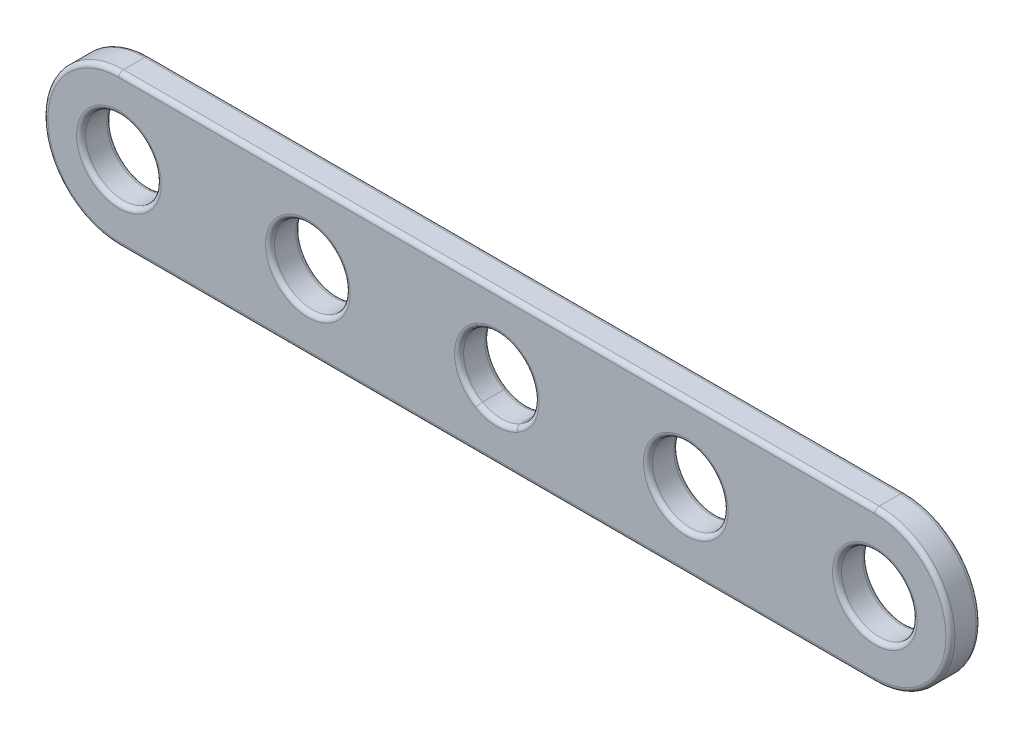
ISO-10303-21;
HEADER;
FILE_DESCRIPTION(('STEP AP214'),'2;1');
FILE_NAME('part.step','',(''),(''),'','','');
FILE_SCHEMA(('AUTOMOTIVE_DESIGN { 1 0 10303 214 1 1 1 1 }'));
ENDSEC;
DATA;
#1=APPLICATION_CONTEXT('core data for automotive mechanical design processes');
#2=APPLICATION_PROTOCOL_DEFINITION('international standard','automotive_design',2000,#1);
#3=PRODUCT_CONTEXT('',#1,'mechanical');
#4=PRODUCT('Part','Part','',(#3));
#5=PRODUCT_RELATED_PRODUCT_CATEGORY('part','',(#4));
#6=PRODUCT_DEFINITION_FORMATION('','',#4);
#7=PRODUCT_DEFINITION_CONTEXT('part definition',#1,'design');
#8=PRODUCT_DEFINITION('design','',#6,#7);
#9=PRODUCT_DEFINITION_SHAPE('','',#8);
#10=(LENGTH_UNIT() NAMED_UNIT(*) SI_UNIT(.MILLI.,.METRE.));
#11=(NAMED_UNIT(*) PLANE_ANGLE_UNIT() SI_UNIT($,.RADIAN.));
#12=(NAMED_UNIT(*) SI_UNIT($,.STERADIAN.) SOLID_ANGLE_UNIT());
#13=UNCERTAINTY_MEASURE_WITH_UNIT(LENGTH_MEASURE(1.E-05),#10,'distance_accuracy_value','');
#14=(GEOMETRIC_REPRESENTATION_CONTEXT(3) GLOBAL_UNCERTAINTY_ASSIGNED_CONTEXT((#13)) GLOBAL_UNIT_ASSIGNED_CONTEXT((#10,
#11,#12)) REPRESENTATION_CONTEXT('',''));
#15=CARTESIAN_POINT('',(0.,0.,0.));
#16=DIRECTION('',(0.,0.,1.));
#17=DIRECTION('',(1.,0.,0.));
#18=AXIS2_PLACEMENT_3D('',#15,#16,#17);
#19=CARTESIAN_POINT('',(250.,50.,0.));
#20=DIRECTION('',(0.,0.,1.));
#21=DIRECTION('',(1.,0.,0.));
#22=AXIS2_PLACEMENT_3D('',#19,#20,#21);
#23=CYLINDRICAL_SURFACE('',#22,25.);
#24=DIRECTION('',(0.,0.,1.));
#25=VECTOR('',#24,1.);
#26=CARTESIAN_POINT('',(262.5,28.349364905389,0.));
#27=LINE('',#26,#25);
#28=CARTESIAN_POINT('',(262.5,28.349364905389,17.));
#29=VERTEX_POINT('',#28);
#30=CARTESIAN_POINT('',(262.5,28.349364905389,3.));
#31=VERTEX_POINT('',#30);
#32=EDGE_CURVE('E328',#29,#31,#27,.F.);
#33=ORIENTED_EDGE('',*,*,#32,.F.);
#34=CARTESIAN_POINT('',(250.,50.,17.));
#35=DIRECTION('',(0.,0.,1.));
#36=DIRECTION('',(1.,0.,0.));
#37=AXIS2_PLACEMENT_3D('',#34,#35,#36);
#38=CIRCLE('',#37,25.);
#39=CARTESIAN_POINT('',(262.5,71.650635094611,17.));
#40=VERTEX_POINT('',#39);
#41=EDGE_CURVE('E229',#29,#40,#38,.T.);
#42=ORIENTED_EDGE('',*,*,#41,.T.);
#43=DIRECTION('',(0.,0.,1.));
#44=VECTOR('',#43,1.);
#45=CARTESIAN_POINT('',(262.5,71.650635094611,0.));
#46=LINE('',#45,#44);
#47=CARTESIAN_POINT('',(262.5,71.650635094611,3.));
#48=VERTEX_POINT('',#47);
#49=EDGE_CURVE('E324',#48,#40,#46,.T.);
#50=ORIENTED_EDGE('',*,*,#49,.F.);
#51=CARTESIAN_POINT('',(250.,50.,3.));
#52=DIRECTION('',(0.,0.,1.));
#53=DIRECTION('',(1.,0.,0.));
#54=AXIS2_PLACEMENT_3D('',#51,#52,#53);
#55=CIRCLE('',#54,25.);
#56=EDGE_CURVE('E226',#48,#31,#55,.F.);
#57=ORIENTED_EDGE('',*,*,#56,.T.);
#58=EDGE_LOOP('',(#33,#42,#50,#57));
#59=FACE_BOUND('',#58,.T.);
#60=ADVANCED_FACE('F31',(#59),#23,.F.);
#61=DIRECTION('',(0.,0.,1.));
#62=VECTOR('',#61,1.);
#63=CARTESIAN_POINT('',(237.5,28.349364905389,0.));
#64=LINE('',#63,#62);
#65=CARTESIAN_POINT('',(237.5,28.349364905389,3.));
#66=VERTEX_POINT('',#65);
#67=CARTESIAN_POINT('',(237.5,28.349364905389,17.));
#68=VERTEX_POINT('',#67);
#69=EDGE_CURVE('E316',#66,#68,#64,.T.);
#70=ORIENTED_EDGE('',*,*,#69,.T.);
#71=CARTESIAN_POINT('',(250.,50.,17.));
#72=DIRECTION('',(0.,0.,1.));
#73=DIRECTION('',(1.,0.,0.));
#74=AXIS2_PLACEMENT_3D('',#71,#72,#73);
#75=CIRCLE('',#74,25.);
#76=EDGE_CURVE('E224',#68,#29,#75,.T.);
#77=ORIENTED_EDGE('',*,*,#76,.T.);
#78=ORIENTED_EDGE('',*,*,#32,.T.);
#79=CARTESIAN_POINT('',(250.,50.,3.));
#80=DIRECTION('',(0.,0.,1.));
#81=DIRECTION('',(1.,0.,0.));
#82=AXIS2_PLACEMENT_3D('',#79,#80,#81);
#83=CIRCLE('',#82,25.);
#84=EDGE_CURVE('E222',#31,#66,#83,.F.);
#85=ORIENTED_EDGE('',*,*,#84,.T.);
#86=EDGE_LOOP('',(#70,#77,#78,#85));
#87=FACE_BOUND('',#86,.T.);
#88=ADVANCED_FACE('F350',(#87),#23,.F.);
#89=DIRECTION('',(0.,0.,1.));
#90=VECTOR('',#89,1.);
#91=CARTESIAN_POINT('',(237.5,71.650635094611,0.));
#92=LINE('',#91,#90);
#93=CARTESIAN_POINT('',(237.5,71.650635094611,17.));
#94=VERTEX_POINT('',#93);
#95=CARTESIAN_POINT('',(237.5,71.650635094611,3.));
#96=VERTEX_POINT('',#95);
#97=EDGE_CURVE('E320',#94,#96,#92,.F.);
#98=ORIENTED_EDGE('',*,*,#97,.F.);
#99=CARTESIAN_POINT('',(250.,50.,17.));
#100=DIRECTION('',(0.,0.,1.));
#101=DIRECTION('',(1.,0.,0.));
#102=AXIS2_PLACEMENT_3D('',#99,#100,#101);
#103=CIRCLE('',#102,25.);
#104=EDGE_CURVE('E150',#94,#68,#103,.T.);
#105=ORIENTED_EDGE('',*,*,#104,.T.);
#106=ORIENTED_EDGE('',*,*,#69,.F.);
#107=CARTESIAN_POINT('',(250.,50.,3.));
#108=DIRECTION('',(0.,0.,1.));
#109=DIRECTION('',(1.,0.,0.));
#110=AXIS2_PLACEMENT_3D('',#107,#108,#109);
#111=CIRCLE('',#110,25.);
#112=EDGE_CURVE('E219',#66,#96,#111,.F.);
#113=ORIENTED_EDGE('',*,*,#112,.T.);
#114=EDGE_LOOP('',(#98,#105,#106,#113));
#115=FACE_BOUND('',#114,.T.);
#116=ADVANCED_FACE('F348',(#115),#23,.F.);
#117=CARTESIAN_POINT('',(0.,50.,20.));
#118=DIRECTION('',(0.,0.,-1.));
#119=DIRECTION('',(-1.,0.,0.));
#120=AXIS2_PLACEMENT_3D('',#117,#118,#119);
#121=CYLINDRICAL_SURFACE('',#120,50.);
#122=DIRECTION('',(0.,0.,-1.));
#123=VECTOR('',#122,1.);
#124=CARTESIAN_POINT('',(0.,0.,20.));
#125=LINE('',#124,#123);
#126=CARTESIAN_POINT('',(0.,0.,17.));
#127=VERTEX_POINT('',#126);
#128=CARTESIAN_POINT('',(0.,0.,3.));
#129=VERTEX_POINT('',#128);
#130=EDGE_CURVE('E313',#127,#129,#125,.T.);
#131=ORIENTED_EDGE('',*,*,#130,.F.);
#132=CARTESIAN_POINT('',(0.,50.,17.));
#133=DIRECTION('',(0.,0.,1.));
#134=DIRECTION('',(1.,0.,0.));
#135=AXIS2_PLACEMENT_3D('',#132,#133,#134);
#136=CIRCLE('',#135,50.);
#137=CARTESIAN_POINT('',(0.,100.,17.));
#138=VERTEX_POINT('',#137);
#139=EDGE_CURVE('E205',#127,#138,#136,.F.);
#140=ORIENTED_EDGE('',*,*,#139,.T.);
#141=DIRECTION('',(0.,0.,-1.));
#142=VECTOR('',#141,1.);
#143=CARTESIAN_POINT('',(0.,100.,20.));
#144=LINE('',#143,#142);
#145=CARTESIAN_POINT('',(0.,100.,3.));
#146=VERTEX_POINT('',#145);
#147=EDGE_CURVE('E304',#138,#146,#144,.T.);
#148=ORIENTED_EDGE('',*,*,#147,.T.);
#149=CARTESIAN_POINT('',(0.,50.,3.));
#150=DIRECTION('',(0.,0.,1.));
#151=DIRECTION('',(1.,0.,0.));
#152=AXIS2_PLACEMENT_3D('',#149,#150,#151);
#153=CIRCLE('',#152,50.);
#154=EDGE_CURVE('E203',#146,#129,#153,.T.);
#155=ORIENTED_EDGE('',*,*,#154,.T.);
#156=EDGE_LOOP('',(#131,#140,#148,#155));
#157=FACE_BOUND('',#156,.T.);
#158=ADVANCED_FACE('F33',(#157),#121,.T.);
#159=CARTESIAN_POINT('',(0.,0.,20.));
#160=DIRECTION('',(0.,1.,0.));
#161=DIRECTION('',(0.,0.,1.));
#162=AXIS2_PLACEMENT_3D('',#159,#160,#161);
#163=PLANE('',#162);
#164=DIRECTION('',(0.,0.,-1.));
#165=VECTOR('',#164,1.);
#166=CARTESIAN_POINT('',(500.,0.,20.));
#167=LINE('',#166,#165);
#168=CARTESIAN_POINT('',(500.,0.,17.));
#169=VERTEX_POINT('',#168);
#170=CARTESIAN_POINT('',(500.,0.,3.));
#171=VERTEX_POINT('',#170);
#172=EDGE_CURVE('E310',#169,#171,#167,.T.);
#173=ORIENTED_EDGE('',*,*,#172,.F.);
#174=DIRECTION('',(1.,0.,0.));
#175=VECTOR('',#174,1.);
#176=CARTESIAN_POINT('',(0.,0.,17.));
#177=LINE('',#176,#175);
#178=EDGE_CURVE('E201',#169,#127,#177,.F.);
#179=ORIENTED_EDGE('',*,*,#178,.T.);
#180=ORIENTED_EDGE('',*,*,#130,.T.);
#181=DIRECTION('',(1.,0.,0.));
#182=VECTOR('',#181,1.);
#183=CARTESIAN_POINT('',(0.,0.,3.));
#184=LINE('',#183,#182);
#185=EDGE_CURVE('E198',#129,#171,#184,.T.);
#186=ORIENTED_EDGE('',*,*,#185,.T.);
#187=EDGE_LOOP('',(#173,#179,#180,#186));
#188=FACE_BOUND('',#187,.T.);
#189=ADVANCED_FACE('F387',(#188),#163,.F.);
#190=CARTESIAN_POINT('',(500.,50.,20.));
#191=DIRECTION('',(0.,0.,-1.));
#192=DIRECTION('',(-1.,0.,0.));
#193=AXIS2_PLACEMENT_3D('',#190,#191,#192);
#194=CYLINDRICAL_SURFACE('',#193,50.);
#195=DIRECTION('',(0.,0.,-1.));
#196=VECTOR('',#195,1.);
#197=CARTESIAN_POINT('',(500.,100.,20.));
#198=LINE('',#197,#196);
#199=CARTESIAN_POINT('',(500.,100.,17.));
#200=VERTEX_POINT('',#199);
#201=CARTESIAN_POINT('',(500.,100.,3.));
#202=VERTEX_POINT('',#201);
#203=EDGE_CURVE('E307',#200,#202,#198,.T.);
#204=ORIENTED_EDGE('',*,*,#203,.F.);
#205=CARTESIAN_POINT('',(500.,50.,17.));
#206=DIRECTION('',(0.,0.,1.));
#207=DIRECTION('',(1.,0.,0.));
#208=AXIS2_PLACEMENT_3D('',#205,#206,#207);
#209=CIRCLE('',#208,50.);
#210=EDGE_CURVE('E196',#200,#169,#209,.F.);
#211=ORIENTED_EDGE('',*,*,#210,.T.);
#212=ORIENTED_EDGE('',*,*,#172,.T.);
#213=CARTESIAN_POINT('',(500.,50.,3.));
#214=DIRECTION('',(0.,0.,1.));
#215=DIRECTION('',(1.,0.,0.));
#216=AXIS2_PLACEMENT_3D('',#213,#214,#215);
#217=CIRCLE('',#216,50.);
#218=EDGE_CURVE('E194',#171,#202,#217,.T.);
#219=ORIENTED_EDGE('',*,*,#218,.T.);
#220=EDGE_LOOP('',(#204,#211,#212,#219));
#221=FACE_BOUND('',#220,.T.);
#222=ADVANCED_FACE('F392',(#221),#194,.T.);
#223=CARTESIAN_POINT('',(0.,100.,20.));
#224=DIRECTION('',(0.,-1.,0.));
#225=DIRECTION('',(0.,0.,-1.));
#226=AXIS2_PLACEMENT_3D('',#223,#224,#225);
#227=PLANE('',#226);
#228=ORIENTED_EDGE('',*,*,#147,.F.);
#229=DIRECTION('',(-1.,0.,0.));
#230=VECTOR('',#229,1.);
#231=CARTESIAN_POINT('',(500.,100.,17.));
#232=LINE('',#231,#230);
#233=EDGE_CURVE('E191',#138,#200,#232,.F.);
#234=ORIENTED_EDGE('',*,*,#233,.T.);
#235=ORIENTED_EDGE('',*,*,#203,.T.);
#236=DIRECTION('',(-1.,0.,0.));
#237=VECTOR('',#236,1.);
#238=CARTESIAN_POINT('',(0.,100.,3.));
#239=LINE('',#238,#237);
#240=EDGE_CURVE('E189',#202,#146,#239,.T.);
#241=ORIENTED_EDGE('',*,*,#240,.T.);
#242=EDGE_LOOP('',(#228,#234,#235,#241));
#243=FACE_BOUND('',#242,.T.);
#244=ADVANCED_FACE('F403',(#243),#227,.F.);
#245=CARTESIAN_POINT('',(0.,50.,20.));
#246=DIRECTION('',(0.,0.,1.));
#247=DIRECTION('',(1.,0.,0.));
#248=AXIS2_PLACEMENT_3D('',#245,#246,#247);
#249=PLANE('',#248);
#250=CARTESIAN_POINT('',(500.,50.,20.));
#251=DIRECTION('',(0.,0.,1.));
#252=DIRECTION('',(1.,0.,0.));
#253=AXIS2_PLACEMENT_3D('',#250,#251,#252);
#254=CIRCLE('',#253,47.);
#255=CARTESIAN_POINT('',(500.,3.,20.));
#256=VERTEX_POINT('',#255);
#257=CARTESIAN_POINT('',(500.,97.,20.));
#258=VERTEX_POINT('',#257);
#259=EDGE_CURVE('E184',#256,#258,#254,.T.);
#260=ORIENTED_EDGE('',*,*,#259,.T.);
#261=DIRECTION('',(-1.,0.,0.));
#262=VECTOR('',#261,1.);
#263=CARTESIAN_POINT('',(0.,97.,20.));
#264=LINE('',#263,#262);
#265=CARTESIAN_POINT('',(0.,97.,20.));
#266=VERTEX_POINT('',#265);
#267=EDGE_CURVE('E186',#258,#266,#264,.T.);
#268=ORIENTED_EDGE('',*,*,#267,.T.);
#269=CARTESIAN_POINT('',(0.,50.,20.));
#270=DIRECTION('',(0.,0.,1.));
#271=DIRECTION('',(1.,0.,0.));
#272=AXIS2_PLACEMENT_3D('',#269,#270,#271);
#273=CIRCLE('',#272,47.);
#274=CARTESIAN_POINT('',(0.,3.,20.));
#275=VERTEX_POINT('',#274);
#276=EDGE_CURVE('E180',#266,#275,#273,.T.);
#277=ORIENTED_EDGE('',*,*,#276,.T.);
#278=DIRECTION('',(1.,0.,0.));
#279=VECTOR('',#278,1.);
#280=CARTESIAN_POINT('',(500.,3.,20.));
#281=LINE('',#280,#279);
#282=EDGE_CURVE('E182',#275,#256,#281,.T.);
#283=ORIENTED_EDGE('',*,*,#282,.T.);
#284=EDGE_LOOP('',(#260,#268,#277,#283));
#285=FACE_BOUND('',#284,.T.);
#286=CARTESIAN_POINT('',(0.,50.,20.));
#287=DIRECTION('',(0.,0.,1.));
#288=DIRECTION('',(1.,0.,0.));
#289=AXIS2_PLACEMENT_3D('',#286,#287,#288);
#290=CIRCLE('',#289,28.);
#291=CARTESIAN_POINT('',(28.,50.,20.));
#292=VERTEX_POINT('',#291);
#293=EDGE_CURVE('E173',#292,#292,#290,.F.);
#294=ORIENTED_EDGE('',*,*,#293,.T.);
#295=EDGE_LOOP('',(#294));
#296=FACE_BOUND('',#295,.T.);
#297=CARTESIAN_POINT('',(125.,50.,20.));
#298=DIRECTION('',(0.,0.,1.));
#299=DIRECTION('',(1.,0.,0.));
#300=AXIS2_PLACEMENT_3D('',#297,#298,#299);
#301=CIRCLE('',#300,28.);
#302=CARTESIAN_POINT('',(153.,50.,20.));
#303=VERTEX_POINT('',#302);
#304=EDGE_CURVE('E170',#303,#303,#301,.F.);
#305=ORIENTED_EDGE('',*,*,#304,.T.);
#306=EDGE_LOOP('',(#305));
#307=FACE_BOUND('',#306,.T.);
#308=CARTESIAN_POINT('',(250.,50.,20.));
#309=DIRECTION('',(0.,0.,1.));
#310=DIRECTION('',(1.,0.,0.));
#311=AXIS2_PLACEMENT_3D('',#308,#309,#310);
#312=CIRCLE('',#311,28.);
#313=CARTESIAN_POINT('',(264.,25.7512886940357,20.));
#314=VERTEX_POINT('',#313);
#315=CARTESIAN_POINT('',(236.,25.7512886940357,20.));
#316=VERTEX_POINT('',#315);
#317=EDGE_CURVE('E169',#314,#316,#312,.F.);
#318=ORIENTED_EDGE('',*,*,#317,.T.);
#319=CARTESIAN_POINT('',(250.,50.,20.));
#320=DIRECTION('',(0.,0.,1.));
#321=DIRECTION('',(1.,0.,0.));
#322=AXIS2_PLACEMENT_3D('',#319,#320,#321);
#323=CIRCLE('',#322,28.);
#324=CARTESIAN_POINT('',(236.,74.2487113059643,20.));
#325=VERTEX_POINT('',#324);
#326=EDGE_CURVE('E147',#316,#325,#323,.F.);
#327=ORIENTED_EDGE('',*,*,#326,.T.);
#328=CARTESIAN_POINT('',(250.,50.,20.));
#329=DIRECTION('',(0.,0.,1.));
#330=DIRECTION('',(1.,0.,0.));
#331=AXIS2_PLACEMENT_3D('',#328,#329,#330);
#332=CIRCLE('',#331,28.);
#333=CARTESIAN_POINT('',(264.,74.2487113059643,20.));
#334=VERTEX_POINT('',#333);
#335=EDGE_CURVE('E157',#325,#334,#332,.F.);
#336=ORIENTED_EDGE('',*,*,#335,.T.);
#337=CARTESIAN_POINT('',(250.,50.,20.));
#338=DIRECTION('',(0.,0.,1.));
#339=DIRECTION('',(1.,0.,0.));
#340=AXIS2_PLACEMENT_3D('',#337,#338,#339);
#341=CIRCLE('',#340,28.);
#342=EDGE_CURVE('E163',#334,#314,#341,.F.);
#343=ORIENTED_EDGE('',*,*,#342,.T.);
#344=EDGE_LOOP('',(#318,#327,#336,#343));
#345=FACE_BOUND('',#344,.T.);
#346=CARTESIAN_POINT('',(375.,50.,20.));
#347=DIRECTION('',(0.,0.,1.));
#348=DIRECTION('',(1.,0.,0.));
#349=AXIS2_PLACEMENT_3D('',#346,#347,#348);
#350=CIRCLE('',#349,28.);
#351=CARTESIAN_POINT('',(403.,50.,20.));
#352=VERTEX_POINT('',#351);
#353=EDGE_CURVE('E164',#352,#352,#350,.F.);
#354=ORIENTED_EDGE('',*,*,#353,.T.);
#355=EDGE_LOOP('',(#354));
#356=FACE_BOUND('',#355,.T.);
#357=CARTESIAN_POINT('',(500.,50.,20.));
#358=DIRECTION('',(0.,0.,1.));
#359=DIRECTION('',(1.,0.,0.));
#360=AXIS2_PLACEMENT_3D('',#357,#358,#359);
#361=CIRCLE('',#360,28.);
#362=CARTESIAN_POINT('',(528.,50.,20.));
#363=VERTEX_POINT('',#362);
#364=EDGE_CURVE('E332',#363,#363,#361,.F.);
#365=ORIENTED_EDGE('',*,*,#364,.T.);
#366=EDGE_LOOP('',(#365));
#367=FACE_BOUND('',#366,.T.);
#368=ADVANCED_FACE('F166',(#285,#296,#307,#345,#356,#367),#249,.T.);
#369=CARTESIAN_POINT('',(0.,50.,0.));
#370=DIRECTION('',(0.,0.,1.));
#371=DIRECTION('',(1.,0.,0.));
#372=AXIS2_PLACEMENT_3D('',#369,#370,#371);
#373=PLANE('',#372);
#374=CARTESIAN_POINT('',(500.,50.,0.));
#375=DIRECTION('',(0.,0.,1.));
#376=DIRECTION('',(1.,0.,0.));
#377=AXIS2_PLACEMENT_3D('',#374,#375,#376);
#378=CIRCLE('',#377,47.);
#379=CARTESIAN_POINT('',(500.,97.,0.));
#380=VERTEX_POINT('',#379);
#381=CARTESIAN_POINT('',(500.,3.,0.));
#382=VERTEX_POINT('',#381);
#383=EDGE_CURVE('E39',#380,#382,#378,.F.);
#384=ORIENTED_EDGE('',*,*,#383,.T.);
#385=DIRECTION('',(1.,0.,0.));
#386=VECTOR('',#385,1.);
#387=CARTESIAN_POINT('',(0.,3.,0.));
#388=LINE('',#387,#386);
#389=CARTESIAN_POINT('',(0.,3.,0.));
#390=VERTEX_POINT('',#389);
#391=EDGE_CURVE('E12',#382,#390,#388,.F.);
#392=ORIENTED_EDGE('',*,*,#391,.T.);
#393=CARTESIAN_POINT('',(0.,50.,0.));
#394=DIRECTION('',(0.,0.,1.));
#395=DIRECTION('',(1.,0.,0.));
#396=AXIS2_PLACEMENT_3D('',#393,#394,#395);
#397=CIRCLE('',#396,47.);
#398=CARTESIAN_POINT('',(0.,97.,0.));
#399=VERTEX_POINT('',#398);
#400=EDGE_CURVE('E268',#390,#399,#397,.F.);
#401=ORIENTED_EDGE('',*,*,#400,.T.);
#402=DIRECTION('',(-1.,0.,0.));
#403=VECTOR('',#402,1.);
#404=CARTESIAN_POINT('',(0.,97.,0.));
#405=LINE('',#404,#403);
#406=EDGE_CURVE('E49',#399,#380,#405,.F.);
#407=ORIENTED_EDGE('',*,*,#406,.T.);
#408=EDGE_LOOP('',(#384,#392,#401,#407));
#409=FACE_BOUND('',#408,.T.);
#410=CARTESIAN_POINT('',(0.,50.,0.));
#411=DIRECTION('',(0.,0.,1.));
#412=DIRECTION('',(1.,0.,0.));
#413=AXIS2_PLACEMENT_3D('',#410,#411,#412);
#414=CIRCLE('',#413,28.);
#415=CARTESIAN_POINT('',(28.,50.,0.));
#416=VERTEX_POINT('',#415);
#417=EDGE_CURVE('E265',#416,#416,#414,.T.);
#418=ORIENTED_EDGE('',*,*,#417,.T.);
#419=EDGE_LOOP('',(#418));
#420=FACE_BOUND('',#419,.T.);
#421=CARTESIAN_POINT('',(125.,50.,0.));
#422=DIRECTION('',(0.,0.,1.));
#423=DIRECTION('',(1.,0.,0.));
#424=AXIS2_PLACEMENT_3D('',#421,#422,#423);
#425=CIRCLE('',#424,28.);
#426=CARTESIAN_POINT('',(153.,50.,0.));
#427=VERTEX_POINT('',#426);
#428=EDGE_CURVE('E262',#427,#427,#425,.T.);
#429=ORIENTED_EDGE('',*,*,#428,.T.);
#430=EDGE_LOOP('',(#429));
#431=FACE_BOUND('',#430,.T.);
#432=CARTESIAN_POINT('',(250.,50.,0.));
#433=DIRECTION('',(0.,0.,1.));
#434=DIRECTION('',(1.,0.,0.));
#435=AXIS2_PLACEMENT_3D('',#432,#433,#434);
#436=CIRCLE('',#435,28.);
#437=CARTESIAN_POINT('',(236.,25.7512886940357,0.));
#438=VERTEX_POINT('',#437);
#439=CARTESIAN_POINT('',(264.,25.7512886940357,0.));
#440=VERTEX_POINT('',#439);
#441=EDGE_CURVE('E257',#438,#440,#436,.T.);
#442=ORIENTED_EDGE('',*,*,#441,.T.);
#443=CARTESIAN_POINT('',(250.,50.,0.));
#444=DIRECTION('',(0.,0.,1.));
#445=DIRECTION('',(1.,0.,0.));
#446=AXIS2_PLACEMENT_3D('',#443,#444,#445);
#447=CIRCLE('',#446,28.);
#448=CARTESIAN_POINT('',(264.,74.2487113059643,0.));
#449=VERTEX_POINT('',#448);
#450=EDGE_CURVE('E259',#440,#449,#447,.T.);
#451=ORIENTED_EDGE('',*,*,#450,.T.);
#452=CARTESIAN_POINT('',(250.,50.,0.));
#453=DIRECTION('',(0.,0.,1.));
#454=DIRECTION('',(1.,0.,0.));
#455=AXIS2_PLACEMENT_3D('',#452,#453,#454);
#456=CIRCLE('',#455,28.);
#457=CARTESIAN_POINT('',(236.,74.2487113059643,0.));
#458=VERTEX_POINT('',#457);
#459=EDGE_CURVE('E253',#449,#458,#456,.T.);
#460=ORIENTED_EDGE('',*,*,#459,.T.);
#461=CARTESIAN_POINT('',(250.,50.,0.));
#462=DIRECTION('',(0.,0.,1.));
#463=DIRECTION('',(1.,0.,0.));
#464=AXIS2_PLACEMENT_3D('',#461,#462,#463);
#465=CIRCLE('',#464,28.);
#466=EDGE_CURVE('E255',#458,#438,#465,.T.);
#467=ORIENTED_EDGE('',*,*,#466,.T.);
#468=EDGE_LOOP('',(#442,#451,#460,#467));
#469=FACE_BOUND('',#468,.T.);
#470=CARTESIAN_POINT('',(375.,50.,0.));
#471=DIRECTION('',(0.,0.,1.));
#472=DIRECTION('',(1.,0.,0.));
#473=AXIS2_PLACEMENT_3D('',#470,#471,#472);
#474=CIRCLE('',#473,28.);
#475=CARTESIAN_POINT('',(403.,50.,0.));
#476=VERTEX_POINT('',#475);
#477=EDGE_CURVE('E250',#476,#476,#474,.T.);
#478=ORIENTED_EDGE('',*,*,#477,.T.);
#479=EDGE_LOOP('',(#478));
#480=FACE_BOUND('',#479,.T.);
#481=CARTESIAN_POINT('',(500.,50.,0.));
#482=DIRECTION('',(0.,0.,1.));
#483=DIRECTION('',(1.,0.,0.));
#484=AXIS2_PLACEMENT_3D('',#481,#482,#483);
#485=CIRCLE('',#484,28.);
#486=CARTESIAN_POINT('',(528.,50.,0.));
#487=VERTEX_POINT('',#486);
#488=EDGE_CURVE('E247',#487,#487,#485,.T.);
#489=ORIENTED_EDGE('',*,*,#488,.T.);
#490=EDGE_LOOP('',(#489));
#491=FACE_BOUND('',#490,.T.);
#492=ADVANCED_FACE('F271',(#409,#420,#431,#469,#480,#491),#373,.F.);
#493=CARTESIAN_POINT('',(0.,50.,0.));
#494=DIRECTION('',(0.,0.,1.));
#495=DIRECTION('',(1.,0.,0.));
#496=AXIS2_PLACEMENT_3D('',#493,#494,#495);
#497=CYLINDRICAL_SURFACE('',#496,25.);
#498=CARTESIAN_POINT('',(0.,50.,17.));
#499=DIRECTION('',(0.,0.,1.));
#500=DIRECTION('',(1.,0.,0.));
#501=AXIS2_PLACEMENT_3D('',#498,#499,#500);
#502=CIRCLE('',#501,25.);
#503=CARTESIAN_POINT('',(25.,50.,17.));
#504=VERTEX_POINT('',#503);
#505=EDGE_CURVE('E210',#504,#504,#502,.T.);
#506=ORIENTED_EDGE('',*,*,#505,.T.);
#507=EDGE_LOOP('',(#506));
#508=FACE_BOUND('',#507,.T.);
#509=CARTESIAN_POINT('',(0.,50.,3.));
#510=DIRECTION('',(0.,0.,1.));
#511=DIRECTION('',(1.,0.,0.));
#512=AXIS2_PLACEMENT_3D('',#509,#510,#511);
#513=CIRCLE('',#512,25.);
#514=CARTESIAN_POINT('',(25.,50.,3.));
#515=VERTEX_POINT('',#514);
#516=EDGE_CURVE('E207',#515,#515,#513,.F.);
#517=ORIENTED_EDGE('',*,*,#516,.T.);
#518=EDGE_LOOP('',(#517));
#519=FACE_BOUND('',#518,.T.);
#520=ADVANCED_FACE('F441',(#508,#519),#497,.F.);
#521=CARTESIAN_POINT('',(125.,50.,0.));
#522=DIRECTION('',(0.,0.,1.));
#523=DIRECTION('',(1.,0.,0.));
#524=AXIS2_PLACEMENT_3D('',#521,#522,#523);
#525=CYLINDRICAL_SURFACE('',#524,25.);
#526=CARTESIAN_POINT('',(125.,50.,17.));
#527=DIRECTION('',(0.,0.,1.));
#528=DIRECTION('',(1.,0.,0.));
#529=AXIS2_PLACEMENT_3D('',#526,#527,#528);
#530=CIRCLE('',#529,25.);
#531=CARTESIAN_POINT('',(150.,50.,17.));
#532=VERTEX_POINT('',#531);
#533=EDGE_CURVE('E216',#532,#532,#530,.T.);
#534=ORIENTED_EDGE('',*,*,#533,.T.);
#535=EDGE_LOOP('',(#534));
#536=FACE_BOUND('',#535,.T.);
#537=CARTESIAN_POINT('',(125.,50.,3.));
#538=DIRECTION('',(0.,0.,1.));
#539=DIRECTION('',(1.,0.,0.));
#540=AXIS2_PLACEMENT_3D('',#537,#538,#539);
#541=CIRCLE('',#540,25.);
#542=CARTESIAN_POINT('',(150.,50.,3.));
#543=VERTEX_POINT('',#542);
#544=EDGE_CURVE('E213',#543,#543,#541,.F.);
#545=ORIENTED_EDGE('',*,*,#544,.T.);
#546=EDGE_LOOP('',(#545));
#547=FACE_BOUND('',#546,.T.);
#548=ADVANCED_FACE('F433',(#536,#547),#525,.F.);
#549=ORIENTED_EDGE('',*,*,#49,.T.);
#550=CARTESIAN_POINT('',(250.,50.,17.));
#551=DIRECTION('',(0.,0.,1.));
#552=DIRECTION('',(1.,0.,0.));
#553=AXIS2_PLACEMENT_3D('',#550,#551,#552);
#554=CIRCLE('',#553,25.);
#555=EDGE_CURVE('E233',#40,#94,#554,.T.);
#556=ORIENTED_EDGE('',*,*,#555,.T.);
#557=ORIENTED_EDGE('',*,*,#97,.T.);
#558=CARTESIAN_POINT('',(250.,50.,3.));
#559=DIRECTION('',(0.,0.,1.));
#560=DIRECTION('',(1.,0.,0.));
#561=AXIS2_PLACEMENT_3D('',#558,#559,#560);
#562=CIRCLE('',#561,25.);
#563=EDGE_CURVE('E231',#96,#48,#562,.F.);
#564=ORIENTED_EDGE('',*,*,#563,.T.);
#565=EDGE_LOOP('',(#549,#556,#557,#564));
#566=FACE_BOUND('',#565,.T.);
#567=ADVANCED_FACE('F424',(#566),#23,.F.);
#568=CARTESIAN_POINT('',(375.,50.,0.));
#569=DIRECTION('',(0.,0.,1.));
#570=DIRECTION('',(1.,0.,0.));
#571=AXIS2_PLACEMENT_3D('',#568,#569,#570);
#572=CYLINDRICAL_SURFACE('',#571,25.);
#573=CARTESIAN_POINT('',(375.,50.,17.));
#574=DIRECTION('',(0.,0.,1.));
#575=DIRECTION('',(1.,0.,0.));
#576=AXIS2_PLACEMENT_3D('',#573,#574,#575);
#577=CIRCLE('',#576,25.);
#578=CARTESIAN_POINT('',(400.,50.,17.));
#579=VERTEX_POINT('',#578);
#580=EDGE_CURVE('E238',#579,#579,#577,.T.);
#581=ORIENTED_EDGE('',*,*,#580,.T.);
#582=EDGE_LOOP('',(#581));
#583=FACE_BOUND('',#582,.T.);
#584=CARTESIAN_POINT('',(375.,50.,3.));
#585=DIRECTION('',(0.,0.,1.));
#586=DIRECTION('',(1.,0.,0.));
#587=AXIS2_PLACEMENT_3D('',#584,#585,#586);
#588=CIRCLE('',#587,25.);
#589=CARTESIAN_POINT('',(400.,50.,3.));
#590=VERTEX_POINT('',#589);
#591=EDGE_CURVE('E235',#590,#590,#588,.F.);
#592=ORIENTED_EDGE('',*,*,#591,.T.);
#593=EDGE_LOOP('',(#592));
#594=FACE_BOUND('',#593,.T.);
#595=ADVANCED_FACE('F432',(#583,#594),#572,.F.);
#596=CARTESIAN_POINT('',(500.,50.,0.));
#597=DIRECTION('',(0.,0.,1.));
#598=DIRECTION('',(1.,0.,0.));
#599=AXIS2_PLACEMENT_3D('',#596,#597,#598);
#600=CYLINDRICAL_SURFACE('',#599,25.);
#601=CARTESIAN_POINT('',(500.,50.,17.));
#602=DIRECTION('',(0.,0.,1.));
#603=DIRECTION('',(1.,0.,0.));
#604=AXIS2_PLACEMENT_3D('',#601,#602,#603);
#605=CIRCLE('',#604,25.);
#606=CARTESIAN_POINT('',(525.,50.,17.));
#607=VERTEX_POINT('',#606);
#608=EDGE_CURVE('E244',#607,#607,#605,.T.);
#609=ORIENTED_EDGE('',*,*,#608,.T.);
#610=EDGE_LOOP('',(#609));
#611=FACE_BOUND('',#610,.T.);
#612=CARTESIAN_POINT('',(500.,50.,3.));
#613=DIRECTION('',(0.,0.,1.));
#614=DIRECTION('',(1.,0.,0.));
#615=AXIS2_PLACEMENT_3D('',#612,#613,#614);
#616=CIRCLE('',#615,25.);
#617=CARTESIAN_POINT('',(525.,50.,3.));
#618=VERTEX_POINT('',#617);
#619=EDGE_CURVE('E241',#618,#618,#616,.F.);
#620=ORIENTED_EDGE('',*,*,#619,.T.);
#621=EDGE_LOOP('',(#620));
#622=FACE_BOUND('',#621,.T.);
#623=ADVANCED_FACE('F439',(#611,#622),#600,.F.);
#624=CARTESIAN_POINT('',(0.,3.,17.));
#625=DIRECTION('',(-1.,0.,0.));
#626=DIRECTION('',(0.,0.,1.));
#627=AXIS2_PLACEMENT_3D('',#624,#625,#626);
#628=CYLINDRICAL_SURFACE('',#627,3.);
#629=CARTESIAN_POINT('',(0.,3.,17.));
#630=DIRECTION('',(-1.,0.,0.));
#631=DIRECTION('',(0.,0.,1.));
#632=AXIS2_PLACEMENT_3D('',#629,#630,#631);
#633=CIRCLE('',#632,3.);
#634=EDGE_CURVE('E298',#127,#275,#633,.T.);
#635=ORIENTED_EDGE('',*,*,#634,.F.);
#636=ORIENTED_EDGE('',*,*,#178,.F.);
#637=CARTESIAN_POINT('',(500.,3.,17.));
#638=DIRECTION('',(1.,0.,0.));
#639=DIRECTION('',(0.,0.,-1.));
#640=AXIS2_PLACEMENT_3D('',#637,#638,#639);
#641=CIRCLE('',#640,3.);
#642=EDGE_CURVE('E301',#256,#169,#641,.T.);
#643=ORIENTED_EDGE('',*,*,#642,.F.);
#644=ORIENTED_EDGE('',*,*,#282,.F.);
#645=EDGE_LOOP('',(#635,#636,#643,#644));
#646=FACE_BOUND('',#645,.T.);
#647=ADVANCED_FACE('F416',(#646),#628,.T.);
#648=CARTESIAN_POINT('',(500.,50.,17.));
#649=DIRECTION('',(0.,0.,1.));
#650=DIRECTION('',(1.,0.,0.));
#651=AXIS2_PLACEMENT_3D('',#648,#649,#650);
#652=TOROIDAL_SURFACE('',#651,47.,3.);
#653=ORIENTED_EDGE('',*,*,#642,.T.);
#654=ORIENTED_EDGE('',*,*,#210,.F.);
#655=CARTESIAN_POINT('',(500.,97.,17.));
#656=DIRECTION('',(-1.,0.,0.));
#657=DIRECTION('',(0.,0.,1.));
#658=AXIS2_PLACEMENT_3D('',#655,#656,#657);
#659=CIRCLE('',#658,3.);
#660=EDGE_CURVE('E296',#258,#200,#659,.T.);
#661=ORIENTED_EDGE('',*,*,#660,.F.);
#662=ORIENTED_EDGE('',*,*,#259,.F.);
#663=EDGE_LOOP('',(#653,#654,#661,#662));
#664=FACE_BOUND('',#663,.T.);
#665=ADVANCED_FACE('F396',(#664),#652,.T.);
#666=CARTESIAN_POINT('',(0.,50.,17.));
#667=DIRECTION('',(0.,0.,1.));
#668=DIRECTION('',(1.,0.,0.));
#669=AXIS2_PLACEMENT_3D('',#666,#667,#668);
#670=TOROIDAL_SURFACE('',#669,47.,3.);
#671=ORIENTED_EDGE('',*,*,#634,.T.);
#672=ORIENTED_EDGE('',*,*,#276,.F.);
#673=CARTESIAN_POINT('',(0.,97.,17.));
#674=DIRECTION('',(1.,0.,0.));
#675=DIRECTION('',(0.,0.,-1.));
#676=AXIS2_PLACEMENT_3D('',#673,#674,#675);
#677=CIRCLE('',#676,3.);
#678=EDGE_CURVE('E294',#138,#266,#677,.T.);
#679=ORIENTED_EDGE('',*,*,#678,.F.);
#680=ORIENTED_EDGE('',*,*,#139,.F.);
#681=EDGE_LOOP('',(#671,#672,#679,#680));
#682=FACE_BOUND('',#681,.T.);
#683=ADVANCED_FACE('F410',(#682),#670,.T.);
#684=CARTESIAN_POINT('',(0.,97.,17.));
#685=DIRECTION('',(1.,0.,0.));
#686=DIRECTION('',(0.,0.,-1.));
#687=AXIS2_PLACEMENT_3D('',#684,#685,#686);
#688=CYLINDRICAL_SURFACE('',#687,3.);
#689=ORIENTED_EDGE('',*,*,#660,.T.);
#690=ORIENTED_EDGE('',*,*,#233,.F.);
#691=ORIENTED_EDGE('',*,*,#678,.T.);
#692=ORIENTED_EDGE('',*,*,#267,.F.);
#693=EDGE_LOOP('',(#689,#690,#691,#692));
#694=FACE_BOUND('',#693,.T.);
#695=ADVANCED_FACE('F406',(#694),#688,.T.);
#696=CARTESIAN_POINT('',(0.,50.,17.));
#697=DIRECTION('',(0.,0.,1.));
#698=DIRECTION('',(1.,0.,0.));
#699=AXIS2_PLACEMENT_3D('',#696,#697,#698);
#700=TOROIDAL_SURFACE('',#699,28.,3.);
#701=ORIENTED_EDGE('',*,*,#293,.F.);
#702=EDGE_LOOP('',(#701));
#703=FACE_BOUND('',#702,.T.);
#704=ORIENTED_EDGE('',*,*,#505,.F.);
#705=EDGE_LOOP('',(#704));
#706=FACE_BOUND('',#705,.T.);
#707=ADVANCED_FACE('F512',(#703,#706),#700,.T.);
#708=CARTESIAN_POINT('',(125.,50.,17.));
#709=DIRECTION('',(0.,0.,1.));
#710=DIRECTION('',(1.,0.,0.));
#711=AXIS2_PLACEMENT_3D('',#708,#709,#710);
#712=TOROIDAL_SURFACE('',#711,28.,3.);
#713=ORIENTED_EDGE('',*,*,#304,.F.);
#714=EDGE_LOOP('',(#713));
#715=FACE_BOUND('',#714,.T.);
#716=ORIENTED_EDGE('',*,*,#533,.F.);
#717=EDGE_LOOP('',(#716));
#718=FACE_BOUND('',#717,.T.);
#719=ADVANCED_FACE('F509',(#715,#718),#712,.T.);
#720=CARTESIAN_POINT('',(250.,50.,17.));
#721=DIRECTION('',(0.,0.,1.));
#722=DIRECTION('',(1.,0.,0.));
#723=AXIS2_PLACEMENT_3D('',#720,#721,#722);
#724=TOROIDAL_SURFACE('',#723,28.,3.);
#725=CARTESIAN_POINT('',(264.,25.7512886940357,17.));
#726=DIRECTION('',(-0.866025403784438,-0.500000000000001,0.));
#727=DIRECTION('',(0.500000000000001,-0.866025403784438,0.));
#728=AXIS2_PLACEMENT_3D('',#725,#726,#727);
#729=CIRCLE('',#728,3.);
#730=EDGE_CURVE('E153',#314,#29,#729,.T.);
#731=ORIENTED_EDGE('',*,*,#730,.F.);
#732=ORIENTED_EDGE('',*,*,#342,.F.);
#733=CARTESIAN_POINT('',(264.,74.2487113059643,17.));
#734=DIRECTION('',(-0.866025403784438,0.500000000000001,0.));
#735=DIRECTION('',(-0.500000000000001,-0.866025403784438,0.));
#736=AXIS2_PLACEMENT_3D('',#733,#734,#735);
#737=CIRCLE('',#736,3.);
#738=EDGE_CURVE('E160',#40,#334,#737,.T.);
#739=ORIENTED_EDGE('',*,*,#738,.F.);
#740=ORIENTED_EDGE('',*,*,#41,.F.);
#741=EDGE_LOOP('',(#731,#732,#739,#740));
#742=FACE_BOUND('',#741,.T.);
#743=ADVANCED_FACE('F339',(#742),#724,.T.);
#744=CARTESIAN_POINT('',(250.,50.,17.));
#745=DIRECTION('',(0.,0.,1.));
#746=DIRECTION('',(1.,0.,0.));
#747=AXIS2_PLACEMENT_3D('',#744,#745,#746);
#748=TOROIDAL_SURFACE('',#747,28.,3.);
#749=ORIENTED_EDGE('',*,*,#738,.T.);
#750=ORIENTED_EDGE('',*,*,#335,.F.);
#751=CARTESIAN_POINT('',(236.,74.2487113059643,17.));
#752=DIRECTION('',(-0.866025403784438,-0.500000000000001,0.));
#753=DIRECTION('',(0.500000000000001,-0.866025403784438,0.));
#754=AXIS2_PLACEMENT_3D('',#751,#752,#753);
#755=CIRCLE('',#754,3.);
#756=EDGE_CURVE('E143',#94,#325,#755,.T.);
#757=ORIENTED_EDGE('',*,*,#756,.F.);
#758=ORIENTED_EDGE('',*,*,#555,.F.);
#759=EDGE_LOOP('',(#749,#750,#757,#758));
#760=FACE_BOUND('',#759,.T.);
#761=ADVANCED_FACE('F158',(#760),#748,.T.);
#762=CARTESIAN_POINT('',(250.,50.,17.));
#763=DIRECTION('',(0.,0.,1.));
#764=DIRECTION('',(1.,0.,0.));
#765=AXIS2_PLACEMENT_3D('',#762,#763,#764);
#766=TOROIDAL_SURFACE('',#765,28.,3.);
#767=ORIENTED_EDGE('',*,*,#730,.T.);
#768=ORIENTED_EDGE('',*,*,#76,.F.);
#769=CARTESIAN_POINT('',(236.,25.7512886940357,17.));
#770=DIRECTION('',(-0.866025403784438,0.500000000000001,0.));
#771=DIRECTION('',(-0.500000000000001,-0.866025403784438,0.));
#772=AXIS2_PLACEMENT_3D('',#769,#770,#771);
#773=CIRCLE('',#772,3.);
#774=EDGE_CURVE('E154',#316,#68,#773,.T.);
#775=ORIENTED_EDGE('',*,*,#774,.F.);
#776=ORIENTED_EDGE('',*,*,#317,.F.);
#777=EDGE_LOOP('',(#767,#768,#775,#776));
#778=FACE_BOUND('',#777,.T.);
#779=ADVANCED_FACE('F342',(#778),#766,.T.);
#780=CARTESIAN_POINT('',(250.,50.,17.));
#781=DIRECTION('',(0.,0.,1.));
#782=DIRECTION('',(1.,0.,0.));
#783=AXIS2_PLACEMENT_3D('',#780,#781,#782);
#784=TOROIDAL_SURFACE('',#783,28.,3.);
#785=ORIENTED_EDGE('',*,*,#756,.T.);
#786=ORIENTED_EDGE('',*,*,#326,.F.);
#787=ORIENTED_EDGE('',*,*,#774,.T.);
#788=ORIENTED_EDGE('',*,*,#104,.F.);
#789=EDGE_LOOP('',(#785,#786,#787,#788));
#790=FACE_BOUND('',#789,.T.);
#791=ADVANCED_FACE('F145',(#790),#784,.T.);
#792=CARTESIAN_POINT('',(375.,50.,17.));
#793=DIRECTION('',(0.,0.,1.));
#794=DIRECTION('',(1.,0.,0.));
#795=AXIS2_PLACEMENT_3D('',#792,#793,#794);
#796=TOROIDAL_SURFACE('',#795,28.,3.);
#797=ORIENTED_EDGE('',*,*,#353,.F.);
#798=EDGE_LOOP('',(#797));
#799=FACE_BOUND('',#798,.T.);
#800=ORIENTED_EDGE('',*,*,#580,.F.);
#801=EDGE_LOOP('',(#800));
#802=FACE_BOUND('',#801,.T.);
#803=ADVANCED_FACE('F496',(#799,#802),#796,.T.);
#804=CARTESIAN_POINT('',(500.,50.,17.));
#805=DIRECTION('',(0.,0.,1.));
#806=DIRECTION('',(1.,0.,0.));
#807=AXIS2_PLACEMENT_3D('',#804,#805,#806);
#808=TOROIDAL_SURFACE('',#807,28.,3.);
#809=ORIENTED_EDGE('',*,*,#364,.F.);
#810=EDGE_LOOP('',(#809));
#811=FACE_BOUND('',#810,.T.);
#812=ORIENTED_EDGE('',*,*,#608,.F.);
#813=EDGE_LOOP('',(#812));
#814=FACE_BOUND('',#813,.T.);
#815=ADVANCED_FACE('F493',(#811,#814),#808,.T.);
#816=CARTESIAN_POINT('',(0.,97.,3.));
#817=DIRECTION('',(-1.,0.,0.));
#818=DIRECTION('',(0.,0.,1.));
#819=AXIS2_PLACEMENT_3D('',#816,#817,#818);
#820=CYLINDRICAL_SURFACE('',#819,3.);
#821=CARTESIAN_POINT('',(500.,97.,3.));
#822=DIRECTION('',(1.,0.,0.));
#823=DIRECTION('',(0.,0.,-1.));
#824=AXIS2_PLACEMENT_3D('',#821,#822,#823);
#825=CIRCLE('',#824,3.);
#826=EDGE_CURVE('E283',#380,#202,#825,.T.);
#827=ORIENTED_EDGE('',*,*,#826,.F.);
#828=ORIENTED_EDGE('',*,*,#406,.F.);
#829=CARTESIAN_POINT('',(0.,97.,3.));
#830=DIRECTION('',(-1.,0.,0.));
#831=DIRECTION('',(0.,0.,1.));
#832=AXIS2_PLACEMENT_3D('',#829,#830,#831);
#833=CIRCLE('',#832,3.);
#834=EDGE_CURVE('E280',#146,#399,#833,.T.);
#835=ORIENTED_EDGE('',*,*,#834,.F.);
#836=ORIENTED_EDGE('',*,*,#240,.F.);
#837=EDGE_LOOP('',(#827,#828,#835,#836));
#838=FACE_BOUND('',#837,.T.);
#839=ADVANCED_FACE('F278',(#838),#820,.T.);
#840=CARTESIAN_POINT('',(0.,50.,3.));
#841=DIRECTION('',(0.,0.,1.));
#842=DIRECTION('',(1.,0.,0.));
#843=AXIS2_PLACEMENT_3D('',#840,#841,#842);
#844=TOROIDAL_SURFACE('',#843,47.,3.);
#845=ORIENTED_EDGE('',*,*,#834,.T.);
#846=ORIENTED_EDGE('',*,*,#400,.F.);
#847=CARTESIAN_POINT('',(0.,3.,3.));
#848=DIRECTION('',(1.,0.,0.));
#849=DIRECTION('',(0.,0.,-1.));
#850=AXIS2_PLACEMENT_3D('',#847,#848,#849);
#851=CIRCLE('',#850,3.);
#852=EDGE_CURVE('E287',#129,#390,#851,.T.);
#853=ORIENTED_EDGE('',*,*,#852,.F.);
#854=ORIENTED_EDGE('',*,*,#154,.F.);
#855=EDGE_LOOP('',(#845,#846,#853,#854));
#856=FACE_BOUND('',#855,.T.);
#857=ADVANCED_FACE('F284',(#856),#844,.T.);
#858=CARTESIAN_POINT('',(500.,50.,3.));
#859=DIRECTION('',(0.,0.,1.));
#860=DIRECTION('',(1.,0.,0.));
#861=AXIS2_PLACEMENT_3D('',#858,#859,#860);
#862=TOROIDAL_SURFACE('',#861,47.,3.);
#863=ORIENTED_EDGE('',*,*,#826,.T.);
#864=ORIENTED_EDGE('',*,*,#218,.F.);
#865=CARTESIAN_POINT('',(500.,3.,3.));
#866=DIRECTION('',(-1.,0.,0.));
#867=DIRECTION('',(0.,0.,1.));
#868=AXIS2_PLACEMENT_3D('',#865,#866,#867);
#869=CIRCLE('',#868,3.);
#870=EDGE_CURVE('E379',#382,#171,#869,.T.);
#871=ORIENTED_EDGE('',*,*,#870,.F.);
#872=ORIENTED_EDGE('',*,*,#383,.F.);
#873=EDGE_LOOP('',(#863,#864,#871,#872));
#874=FACE_BOUND('',#873,.T.);
#875=ADVANCED_FACE('F485',(#874),#862,.T.);
#876=CARTESIAN_POINT('',(0.,3.,3.));
#877=DIRECTION('',(1.,0.,0.));
#878=DIRECTION('',(0.,0.,-1.));
#879=AXIS2_PLACEMENT_3D('',#876,#877,#878);
#880=CYLINDRICAL_SURFACE('',#879,3.);
#881=ORIENTED_EDGE('',*,*,#852,.T.);
#882=ORIENTED_EDGE('',*,*,#391,.F.);
#883=ORIENTED_EDGE('',*,*,#870,.T.);
#884=ORIENTED_EDGE('',*,*,#185,.F.);
#885=EDGE_LOOP('',(#881,#882,#883,#884));
#886=FACE_BOUND('',#885,.T.);
#887=ADVANCED_FACE('F382',(#886),#880,.T.);
#888=CARTESIAN_POINT('',(0.,50.,3.));
#889=DIRECTION('',(0.,0.,1.));
#890=DIRECTION('',(1.,0.,0.));
#891=AXIS2_PLACEMENT_3D('',#888,#889,#890);
#892=TOROIDAL_SURFACE('',#891,28.,3.);
#893=ORIENTED_EDGE('',*,*,#516,.F.);
#894=EDGE_LOOP('',(#893));
#895=FACE_BOUND('',#894,.T.);
#896=ORIENTED_EDGE('',*,*,#417,.F.);
#897=EDGE_LOOP('',(#896));
#898=FACE_BOUND('',#897,.T.);
#899=ADVANCED_FACE('F478',(#895,#898),#892,.T.);
#900=CARTESIAN_POINT('',(125.,50.,3.));
#901=DIRECTION('',(0.,0.,1.));
#902=DIRECTION('',(1.,0.,0.));
#903=AXIS2_PLACEMENT_3D('',#900,#901,#902);
#904=TOROIDAL_SURFACE('',#903,28.,3.);
#905=ORIENTED_EDGE('',*,*,#544,.F.);
#906=EDGE_LOOP('',(#905));
#907=FACE_BOUND('',#906,.T.);
#908=ORIENTED_EDGE('',*,*,#428,.F.);
#909=EDGE_LOOP('',(#908));
#910=FACE_BOUND('',#909,.T.);
#911=ADVANCED_FACE('F475',(#907,#910),#904,.T.);
#912=CARTESIAN_POINT('',(250.,50.,3.));
#913=DIRECTION('',(0.,0.,1.));
#914=DIRECTION('',(1.,0.,0.));
#915=AXIS2_PLACEMENT_3D('',#912,#913,#914);
#916=TOROIDAL_SURFACE('',#915,28.,3.);
#917=CARTESIAN_POINT('',(236.,74.2487113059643,3.));
#918=DIRECTION('',(0.866025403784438,0.500000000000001,0.));
#919=DIRECTION('',(-0.500000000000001,0.866025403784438,0.));
#920=AXIS2_PLACEMENT_3D('',#917,#918,#919);
#921=CIRCLE('',#920,3.);
#922=EDGE_CURVE('E374',#96,#458,#921,.T.);
#923=ORIENTED_EDGE('',*,*,#922,.F.);
#924=ORIENTED_EDGE('',*,*,#112,.F.);
#925=CARTESIAN_POINT('',(236.,25.7512886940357,3.));
#926=DIRECTION('',(0.866025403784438,-0.500000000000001,0.));
#927=DIRECTION('',(0.500000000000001,0.866025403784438,0.));
#928=AXIS2_PLACEMENT_3D('',#925,#926,#927);
#929=CIRCLE('',#928,3.);
#930=EDGE_CURVE('E360',#438,#66,#929,.T.);
#931=ORIENTED_EDGE('',*,*,#930,.F.);
#932=ORIENTED_EDGE('',*,*,#466,.F.);
#933=EDGE_LOOP('',(#923,#924,#931,#932));
#934=FACE_BOUND('',#933,.T.);
#935=ADVANCED_FACE('F446',(#934),#916,.T.);
#936=CARTESIAN_POINT('',(250.,50.,3.));
#937=DIRECTION('',(0.,0.,1.));
#938=DIRECTION('',(1.,0.,0.));
#939=AXIS2_PLACEMENT_3D('',#936,#937,#938);
#940=TOROIDAL_SURFACE('',#939,28.,3.);
#941=ORIENTED_EDGE('',*,*,#930,.T.);
#942=ORIENTED_EDGE('',*,*,#84,.F.);
#943=CARTESIAN_POINT('',(264.,25.7512886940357,3.));
#944=DIRECTION('',(0.866025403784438,0.500000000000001,0.));
#945=DIRECTION('',(-0.500000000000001,0.866025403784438,0.));
#946=AXIS2_PLACEMENT_3D('',#943,#944,#945);
#947=CIRCLE('',#946,3.);
#948=EDGE_CURVE('E357',#440,#31,#947,.T.);
#949=ORIENTED_EDGE('',*,*,#948,.F.);
#950=ORIENTED_EDGE('',*,*,#441,.F.);
#951=EDGE_LOOP('',(#941,#942,#949,#950));
#952=FACE_BOUND('',#951,.T.);
#953=ADVANCED_FACE('F355',(#952),#940,.T.);
#954=CARTESIAN_POINT('',(250.,50.,3.));
#955=DIRECTION('',(0.,0.,1.));
#956=DIRECTION('',(1.,0.,0.));
#957=AXIS2_PLACEMENT_3D('',#954,#955,#956);
#958=TOROIDAL_SURFACE('',#957,28.,3.);
#959=ORIENTED_EDGE('',*,*,#922,.T.);
#960=ORIENTED_EDGE('',*,*,#459,.F.);
#961=CARTESIAN_POINT('',(264.,74.2487113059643,3.));
#962=DIRECTION('',(0.866025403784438,-0.500000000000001,0.));
#963=DIRECTION('',(0.500000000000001,0.866025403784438,0.));
#964=AXIS2_PLACEMENT_3D('',#961,#962,#963);
#965=CIRCLE('',#964,3.);
#966=EDGE_CURVE('E367',#48,#449,#965,.T.);
#967=ORIENTED_EDGE('',*,*,#966,.F.);
#968=ORIENTED_EDGE('',*,*,#563,.F.);
#969=EDGE_LOOP('',(#959,#960,#967,#968));
#970=FACE_BOUND('',#969,.T.);
#971=ADVANCED_FACE('F372',(#970),#958,.T.);
#972=CARTESIAN_POINT('',(250.,50.,3.));
#973=DIRECTION('',(0.,0.,1.));
#974=DIRECTION('',(1.,0.,0.));
#975=AXIS2_PLACEMENT_3D('',#972,#973,#974);
#976=TOROIDAL_SURFACE('',#975,28.,3.);
#977=ORIENTED_EDGE('',*,*,#948,.T.);
#978=ORIENTED_EDGE('',*,*,#56,.F.);
#979=ORIENTED_EDGE('',*,*,#966,.T.);
#980=ORIENTED_EDGE('',*,*,#450,.F.);
#981=EDGE_LOOP('',(#977,#978,#979,#980));
#982=FACE_BOUND('',#981,.T.);
#983=ADVANCED_FACE('F366',(#982),#976,.T.);
#984=CARTESIAN_POINT('',(375.,50.,3.));
#985=DIRECTION('',(0.,0.,1.));
#986=DIRECTION('',(1.,0.,0.));
#987=AXIS2_PLACEMENT_3D('',#984,#985,#986);
#988=TOROIDAL_SURFACE('',#987,28.,3.);
#989=ORIENTED_EDGE('',*,*,#591,.F.);
#990=EDGE_LOOP('',(#989));
#991=FACE_BOUND('',#990,.T.);
#992=ORIENTED_EDGE('',*,*,#477,.F.);
#993=EDGE_LOOP('',(#992));
#994=FACE_BOUND('',#993,.T.);
#995=ADVANCED_FACE('F457',(#991,#994),#988,.T.);
#996=CARTESIAN_POINT('',(500.,50.,3.));
#997=DIRECTION('',(0.,0.,1.));
#998=DIRECTION('',(1.,0.,0.));
#999=AXIS2_PLACEMENT_3D('',#996,#997,#998);
#1000=TOROIDAL_SURFACE('',#999,28.,3.);
#1001=ORIENTED_EDGE('',*,*,#619,.F.);
#1002=EDGE_LOOP('',(#1001));
#1003=FACE_BOUND('',#1002,.T.);
#1004=ORIENTED_EDGE('',*,*,#488,.F.);
#1005=EDGE_LOOP('',(#1004));
#1006=FACE_BOUND('',#1005,.T.);
#1007=ADVANCED_FACE('F455',(#1003,#1006),#1000,.T.);
#1008=CLOSED_SHELL('',(#60,#88,#116,#158,#189,#222,#244,#368,#492,#520,#548,#567,#595,#623,#647,
#665,#683,#695,#707,#719,#743,#761,#779,#791,#803,#815,#839,#857,#875,#887,#899,#911,#935,#953,
#971,#983,#995,#1007));
#1009=MANIFOLD_SOLID_BREP('B2',#1008);
#1010=ADVANCED_BREP_SHAPE_REPRESENTATION('',(#18,#1009),#14);
#1011=SHAPE_DEFINITION_REPRESENTATION(#9,#1010);
ENDSEC;
END-ISO-10303-21;
